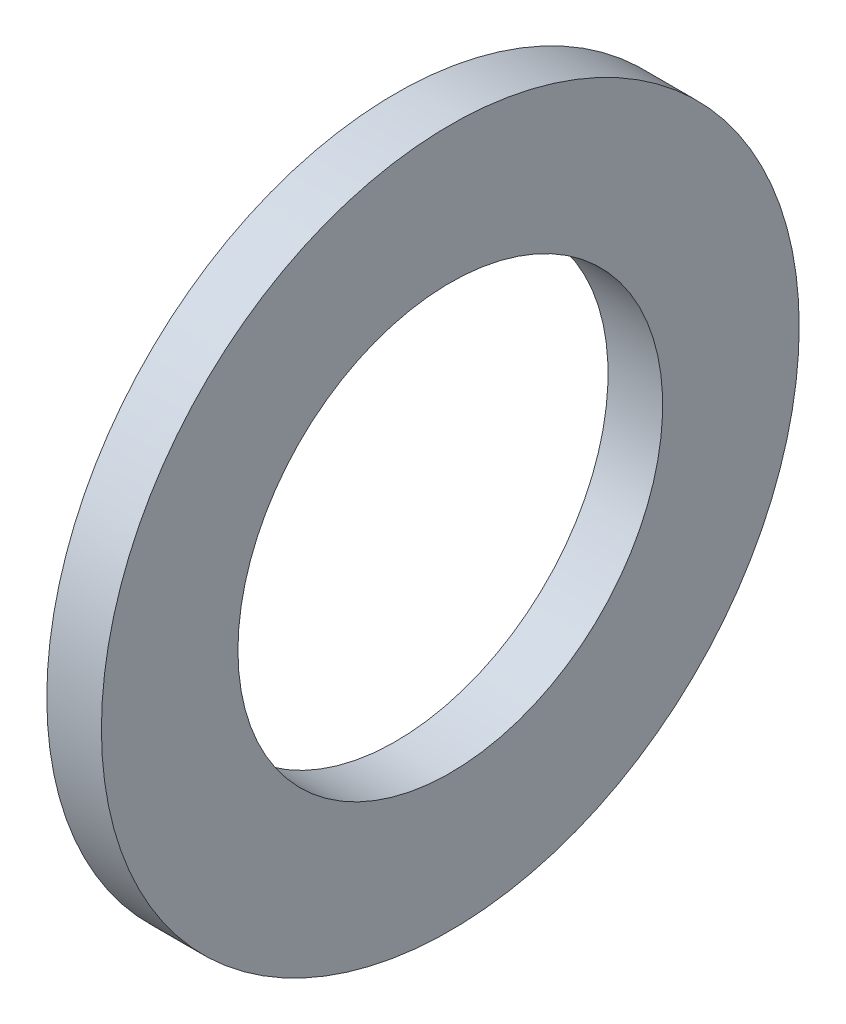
from build123d import *

# Parameters (mm, degrees)
SKETCH1_W = 9
SKETCH1_H = 22.5


with BuildPart() as part:
    # Sketch1 → Base-Revolve (revolve)
    with BuildSketch(Plane.XY, mode=Mode.PRIVATE) as base_revolve_sk:
        with Locations((-4.5, 46.25)):
            Rectangle(SKETCH1_W, SKETCH1_H)
    revolve(base_revolve_sk.sketch.rotate(Axis((-34.925, 0, 0), (1, 0, 0)), 90), axis=Axis((-34.925, 0, 0), (1, 0, 0)))


solid = part.part
